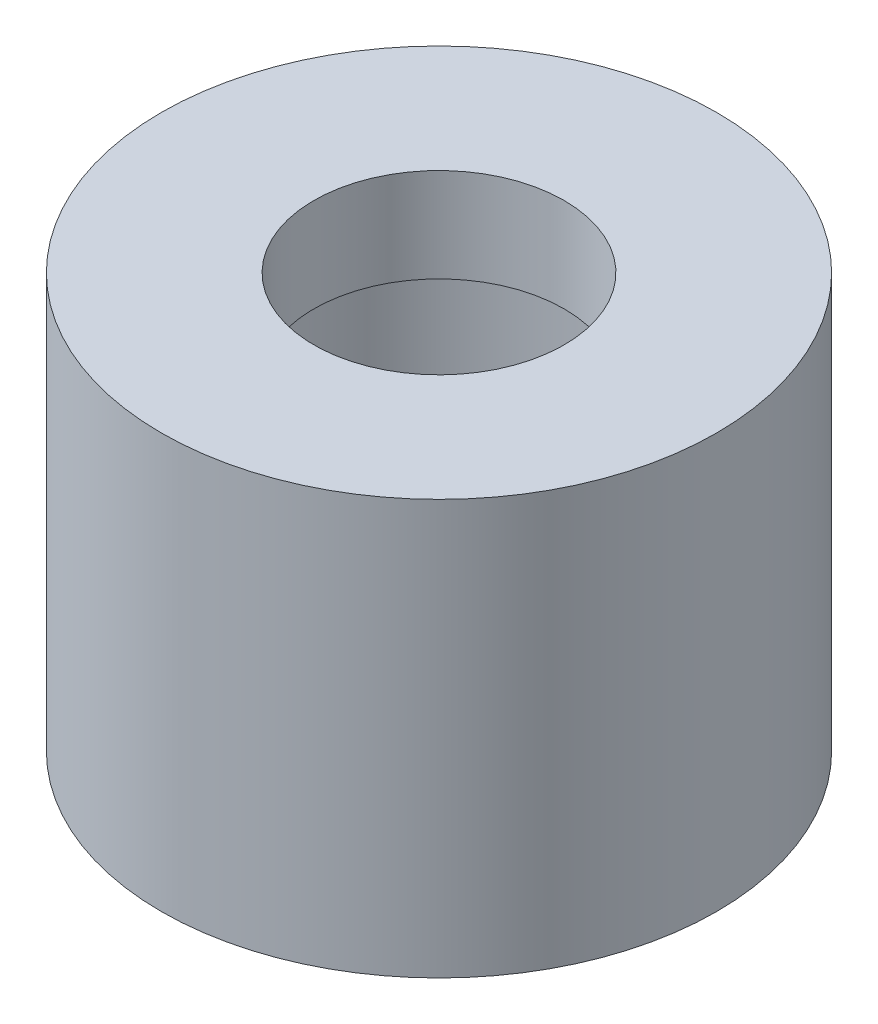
ISO-10303-21;
HEADER;
FILE_DESCRIPTION(('STEP AP214'),'2;1');
FILE_NAME('part.step','',(''),(''),'','','');
FILE_SCHEMA(('AUTOMOTIVE_DESIGN { 1 0 10303 214 1 1 1 1 }'));
ENDSEC;
DATA;
#1=APPLICATION_CONTEXT('core data for automotive mechanical design processes');
#2=APPLICATION_PROTOCOL_DEFINITION('international standard','automotive_design',2000,#1);
#3=PRODUCT_CONTEXT('',#1,'mechanical');
#4=PRODUCT('Part','Part','',(#3));
#5=PRODUCT_RELATED_PRODUCT_CATEGORY('part','',(#4));
#6=PRODUCT_DEFINITION_FORMATION('','',#4);
#7=PRODUCT_DEFINITION_CONTEXT('part definition',#1,'design');
#8=PRODUCT_DEFINITION('design','',#6,#7);
#9=PRODUCT_DEFINITION_SHAPE('','',#8);
#10=(LENGTH_UNIT() NAMED_UNIT(*) SI_UNIT(.MILLI.,.METRE.));
#11=(NAMED_UNIT(*) PLANE_ANGLE_UNIT() SI_UNIT($,.RADIAN.));
#12=(NAMED_UNIT(*) SI_UNIT($,.STERADIAN.) SOLID_ANGLE_UNIT());
#13=UNCERTAINTY_MEASURE_WITH_UNIT(LENGTH_MEASURE(1.E-05),#10,'distance_accuracy_value','');
#14=(GEOMETRIC_REPRESENTATION_CONTEXT(3) GLOBAL_UNCERTAINTY_ASSIGNED_CONTEXT((#13)) GLOBAL_UNIT_ASSIGNED_CONTEXT((#10,
#11,#12)) REPRESENTATION_CONTEXT('',''));
#15=CARTESIAN_POINT('',(0.,0.,0.));
#16=DIRECTION('',(0.,0.,1.));
#17=DIRECTION('',(1.,0.,0.));
#18=AXIS2_PLACEMENT_3D('',#15,#16,#17);
#19=CARTESIAN_POINT('',(0.,0.,0.));
#20=DIRECTION('',(0.,-1.,0.));
#21=DIRECTION('',(0.,0.,-1.));
#22=AXIS2_PLACEMENT_3D('',#19,#20,#21);
#23=CYLINDRICAL_SURFACE('',#22,9.01699999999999);
#24=CARTESIAN_POINT('',(0.,0.,0.));
#25=DIRECTION('',(0.,-1.,0.));
#26=DIRECTION('',(0.,0.,-1.));
#27=AXIS2_PLACEMENT_3D('',#24,#25,#26);
#28=CIRCLE('',#27,9.01699999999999);
#29=CARTESIAN_POINT('',(0.,0.,-9.01699999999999));
#30=VERTEX_POINT('',#29);
#31=EDGE_CURVE('E10',#30,#30,#28,.T.);
#32=ORIENTED_EDGE('',*,*,#31,.F.);
#33=EDGE_LOOP('',(#32));
#34=FACE_BOUND('',#33,.T.);
#35=CARTESIAN_POINT('',(0.,13.462,0.));
#36=DIRECTION('',(0.,-1.,0.));
#37=DIRECTION('',(0.,0.,-1.));
#38=AXIS2_PLACEMENT_3D('',#35,#36,#37);
#39=CIRCLE('',#38,9.017);
#40=CARTESIAN_POINT('',(0.,13.462,-9.01699999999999));
#41=VERTEX_POINT('',#40);
#42=EDGE_CURVE('E50',#41,#41,#39,.T.);
#43=ORIENTED_EDGE('',*,*,#42,.T.);
#44=EDGE_LOOP('',(#43));
#45=FACE_BOUND('',#44,.T.);
#46=ADVANCED_FACE('F28',(#34,#45),#23,.T.);
#47=CARTESIAN_POINT('',(-9.01700000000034,0.,0.));
#48=DIRECTION('',(0.,1.,0.));
#49=DIRECTION('',(0.,0.,1.));
#50=AXIS2_PLACEMENT_3D('',#47,#48,#49);
#51=PLANE('',#50);
#52=CARTESIAN_POINT('',(0.,0.,0.));
#53=DIRECTION('',(0.,-1.,0.));
#54=DIRECTION('',(0.,0.,-1.));
#55=AXIS2_PLACEMENT_3D('',#52,#53,#54);
#56=CIRCLE('',#55,5.715);
#57=CARTESIAN_POINT('',(0.,0.,-5.715));
#58=VERTEX_POINT('',#57);
#59=EDGE_CURVE('E34',#58,#58,#56,.T.);
#60=ORIENTED_EDGE('',*,*,#59,.F.);
#61=EDGE_LOOP('',(#60));
#62=FACE_BOUND('',#61,.T.);
#63=ORIENTED_EDGE('',*,*,#31,.T.);
#64=EDGE_LOOP('',(#63));
#65=FACE_BOUND('',#64,.T.);
#66=ADVANCED_FACE('F75',(#62,#65),#51,.F.);
#67=CARTESIAN_POINT('',(0.,0.,0.));
#68=DIRECTION('',(0.,-1.,0.));
#69=DIRECTION('',(0.,0.,-1.));
#70=AXIS2_PLACEMENT_3D('',#67,#68,#69);
#71=CYLINDRICAL_SURFACE('',#70,5.715);
#72=CARTESIAN_POINT('',(0.,10.4140000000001,0.));
#73=DIRECTION('',(0.,-1.,0.));
#74=DIRECTION('',(0.,0.,-1.));
#75=AXIS2_PLACEMENT_3D('',#72,#73,#74);
#76=CIRCLE('',#75,5.715);
#77=CARTESIAN_POINT('',(0.,10.4140000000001,-5.715));
#78=VERTEX_POINT('',#77);
#79=EDGE_CURVE('E38',#78,#78,#76,.T.);
#80=ORIENTED_EDGE('',*,*,#79,.F.);
#81=EDGE_LOOP('',(#80));
#82=FACE_BOUND('',#81,.T.);
#83=ORIENTED_EDGE('',*,*,#59,.T.);
#84=EDGE_LOOP('',(#83));
#85=FACE_BOUND('',#84,.T.);
#86=ADVANCED_FACE('F70',(#82,#85),#71,.F.);
#87=CARTESIAN_POINT('',(-5.71500000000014,10.414,0.));
#88=DIRECTION('',(0.,1.,0.));
#89=DIRECTION('',(0.,0.,1.));
#90=AXIS2_PLACEMENT_3D('',#87,#88,#89);
#91=PLANE('',#90);
#92=CARTESIAN_POINT('',(0.,10.4140000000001,0.));
#93=DIRECTION('',(0.,-1.,0.));
#94=DIRECTION('',(0.,0.,-1.));
#95=AXIS2_PLACEMENT_3D('',#92,#93,#94);
#96=CIRCLE('',#95,4.064);
#97=CARTESIAN_POINT('',(0.,10.4140000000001,-4.064));
#98=VERTEX_POINT('',#97);
#99=EDGE_CURVE('E42',#98,#98,#96,.T.);
#100=ORIENTED_EDGE('',*,*,#99,.F.);
#101=EDGE_LOOP('',(#100));
#102=FACE_BOUND('',#101,.T.);
#103=ORIENTED_EDGE('',*,*,#79,.T.);
#104=EDGE_LOOP('',(#103));
#105=FACE_BOUND('',#104,.T.);
#106=ADVANCED_FACE('F64',(#102,#105),#91,.F.);
#107=CARTESIAN_POINT('',(0.,0.,0.));
#108=DIRECTION('',(0.,-1.,0.));
#109=DIRECTION('',(0.,0.,-1.));
#110=AXIS2_PLACEMENT_3D('',#107,#108,#109);
#111=CYLINDRICAL_SURFACE('',#110,4.064);
#112=CARTESIAN_POINT('',(0.,13.462,0.));
#113=DIRECTION('',(0.,-1.,0.));
#114=DIRECTION('',(0.,0.,-1.));
#115=AXIS2_PLACEMENT_3D('',#112,#113,#114);
#116=CIRCLE('',#115,4.064);
#117=CARTESIAN_POINT('',(0.,13.462,-4.06399999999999));
#118=VERTEX_POINT('',#117);
#119=EDGE_CURVE('E47',#118,#118,#116,.T.);
#120=ORIENTED_EDGE('',*,*,#119,.F.);
#121=EDGE_LOOP('',(#120));
#122=FACE_BOUND('',#121,.T.);
#123=ORIENTED_EDGE('',*,*,#99,.T.);
#124=EDGE_LOOP('',(#123));
#125=FACE_BOUND('',#124,.T.);
#126=ADVANCED_FACE('F58',(#122,#125),#111,.F.);
#127=CARTESIAN_POINT('',(-4.06400000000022,13.462,0.));
#128=DIRECTION('',(0.,-1.,0.));
#129=DIRECTION('',(0.,0.,-1.));
#130=AXIS2_PLACEMENT_3D('',#127,#128,#129);
#131=PLANE('',#130);
#132=ORIENTED_EDGE('',*,*,#42,.F.);
#133=EDGE_LOOP('',(#132));
#134=FACE_BOUND('',#133,.T.);
#135=ORIENTED_EDGE('',*,*,#119,.T.);
#136=EDGE_LOOP('',(#135));
#137=FACE_BOUND('',#136,.T.);
#138=ADVANCED_FACE('F55',(#134,#137),#131,.F.);
#139=CLOSED_SHELL('',(#46,#66,#86,#106,#126,#138));
#140=MANIFOLD_SOLID_BREP('B2',#139);
#141=ADVANCED_BREP_SHAPE_REPRESENTATION('',(#18,#140),#14);
#142=SHAPE_DEFINITION_REPRESENTATION(#9,#141);
ENDSEC;
END-ISO-10303-21;
